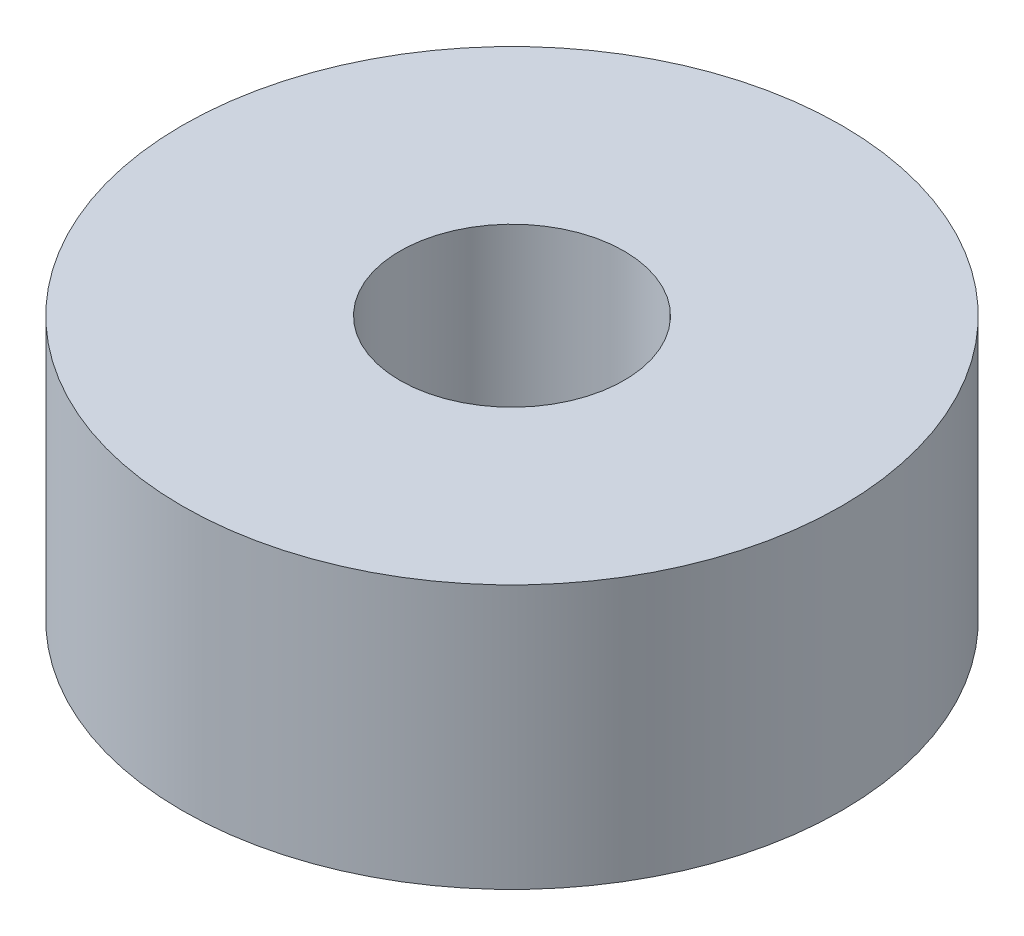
ISO-10303-21;
HEADER;
FILE_DESCRIPTION(('STEP AP214'),'2;1');
FILE_NAME('part.step','',(''),(''),'','','');
FILE_SCHEMA(('AUTOMOTIVE_DESIGN { 1 0 10303 214 1 1 1 1 }'));
ENDSEC;
DATA;
#1=APPLICATION_CONTEXT('core data for automotive mechanical design processes');
#2=APPLICATION_PROTOCOL_DEFINITION('international standard','automotive_design',2000,#1);
#3=PRODUCT_CONTEXT('',#1,'mechanical');
#4=PRODUCT('Part','Part','',(#3));
#5=PRODUCT_RELATED_PRODUCT_CATEGORY('part','',(#4));
#6=PRODUCT_DEFINITION_FORMATION('','',#4);
#7=PRODUCT_DEFINITION_CONTEXT('part definition',#1,'design');
#8=PRODUCT_DEFINITION('design','',#6,#7);
#9=PRODUCT_DEFINITION_SHAPE('','',#8);
#10=(LENGTH_UNIT() NAMED_UNIT(*) SI_UNIT(.MILLI.,.METRE.));
#11=(NAMED_UNIT(*) PLANE_ANGLE_UNIT() SI_UNIT($,.RADIAN.));
#12=(NAMED_UNIT(*) SI_UNIT($,.STERADIAN.) SOLID_ANGLE_UNIT());
#13=UNCERTAINTY_MEASURE_WITH_UNIT(LENGTH_MEASURE(1.E-05),#10,'distance_accuracy_value','');
#14=(GEOMETRIC_REPRESENTATION_CONTEXT(3) GLOBAL_UNCERTAINTY_ASSIGNED_CONTEXT((#13)) GLOBAL_UNIT_ASSIGNED_CONTEXT((#10,
#11,#12)) REPRESENTATION_CONTEXT('',''));
#15=CARTESIAN_POINT('',(0.,0.,0.));
#16=DIRECTION('',(0.,0.,1.));
#17=DIRECTION('',(1.,0.,0.));
#18=AXIS2_PLACEMENT_3D('',#15,#16,#17);
#19=CARTESIAN_POINT('',(-1.11022302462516E-13,4.99999999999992,1.11022302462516E-13));
#20=DIRECTION('',(0.,1.,0.));
#21=DIRECTION('',(0.,0.,1.));
#22=AXIS2_PLACEMENT_3D('',#19,#20,#21);
#23=PLANE('',#22);
#24=CARTESIAN_POINT('',(-1.11022302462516E-13,4.99999999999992,1.11022302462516E-13));
#25=DIRECTION('',(0.,1.,0.));
#26=DIRECTION('',(0.,0.,1.));
#27=AXIS2_PLACEMENT_3D('',#24,#25,#26);
#28=CIRCLE('',#27,12.5);
#29=CARTESIAN_POINT('',(-1.11716191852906E-13,4.99999999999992,12.5000000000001));
#30=VERTEX_POINT('',#29);
#31=EDGE_CURVE('E10',#30,#30,#28,.T.);
#32=ORIENTED_EDGE('',*,*,#31,.T.);
#33=EDGE_LOOP('',(#32));
#34=FACE_BOUND('',#33,.T.);
#35=CARTESIAN_POINT('',(-1.11022302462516E-13,4.99999999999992,1.11022302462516E-13));
#36=DIRECTION('',(0.,1.,0.));
#37=DIRECTION('',(0.,0.,1.));
#38=AXIS2_PLACEMENT_3D('',#35,#36,#37);
#39=CIRCLE('',#38,4.25);
#40=CARTESIAN_POINT('',(-1.11258224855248E-13,4.99999999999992,4.25000000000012));
#41=VERTEX_POINT('',#40);
#42=EDGE_CURVE('E53',#41,#41,#39,.T.);
#43=ORIENTED_EDGE('',*,*,#42,.F.);
#44=EDGE_LOOP('',(#43));
#45=FACE_BOUND('',#44,.T.);
#46=ADVANCED_FACE('F40',(#34,#45),#23,.T.);
#47=CARTESIAN_POINT('',(-1.66533453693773E-13,-5.00000000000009,1.11022302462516E-13));
#48=DIRECTION('',(0.,1.,0.));
#49=DIRECTION('',(0.,0.,1.));
#50=AXIS2_PLACEMENT_3D('',#47,#48,#49);
#51=PLANE('',#50);
#52=CARTESIAN_POINT('',(-1.66533453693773E-13,-5.00000000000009,1.11022302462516E-13));
#53=DIRECTION('',(0.,1.,0.));
#54=DIRECTION('',(0.,0.,1.));
#55=AXIS2_PLACEMENT_3D('',#52,#53,#54);
#56=CIRCLE('',#55,12.5);
#57=CARTESIAN_POINT('',(-1.67227343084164E-13,-5.00000000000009,12.5000000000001));
#58=VERTEX_POINT('',#57);
#59=EDGE_CURVE('E44',#58,#58,#56,.T.);
#60=ORIENTED_EDGE('',*,*,#59,.F.);
#61=EDGE_LOOP('',(#60));
#62=FACE_BOUND('',#61,.T.);
#63=CARTESIAN_POINT('',(-1.66533453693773E-13,-5.00000000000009,1.11022302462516E-13));
#64=DIRECTION('',(0.,1.,0.));
#65=DIRECTION('',(0.,0.,1.));
#66=AXIS2_PLACEMENT_3D('',#63,#64,#65);
#67=CIRCLE('',#66,4.25);
#68=CARTESIAN_POINT('',(-1.66769376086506E-13,-5.00000000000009,4.25000000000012));
#69=VERTEX_POINT('',#68);
#70=EDGE_CURVE('E55',#69,#69,#67,.T.);
#71=ORIENTED_EDGE('',*,*,#70,.T.);
#72=EDGE_LOOP('',(#71));
#73=FACE_BOUND('',#72,.T.);
#74=ADVANCED_FACE('F67',(#62,#73),#51,.F.);
#75=CARTESIAN_POINT('',(-1.11022302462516E-13,4.99999999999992,1.11022302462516E-13));
#76=DIRECTION('',(0.,-1.,0.));
#77=DIRECTION('',(0.,0.,-1.));
#78=AXIS2_PLACEMENT_3D('',#75,#76,#77);
#79=CYLINDRICAL_SURFACE('',#78,12.5);
#80=ORIENTED_EDGE('',*,*,#31,.F.);
#81=EDGE_LOOP('',(#80));
#82=FACE_BOUND('',#81,.T.);
#83=ORIENTED_EDGE('',*,*,#59,.T.);
#84=EDGE_LOOP('',(#83));
#85=FACE_BOUND('',#84,.T.);
#86=ADVANCED_FACE('F42',(#82,#85),#79,.T.);
#87=CARTESIAN_POINT('',(-1.11022302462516E-13,4.99999999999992,1.11022302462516E-13));
#88=DIRECTION('',(0.,-1.,0.));
#89=DIRECTION('',(0.,0.,-1.));
#90=AXIS2_PLACEMENT_3D('',#87,#88,#89);
#91=CYLINDRICAL_SURFACE('',#90,4.25);
#92=ORIENTED_EDGE('',*,*,#42,.T.);
#93=EDGE_LOOP('',(#92));
#94=FACE_BOUND('',#93,.T.);
#95=ORIENTED_EDGE('',*,*,#70,.F.);
#96=EDGE_LOOP('',(#95));
#97=FACE_BOUND('',#96,.T.);
#98=ADVANCED_FACE('F63',(#94,#97),#91,.F.);
#99=CLOSED_SHELL('',(#46,#74,#86,#98));
#100=MANIFOLD_SOLID_BREP('B2',#99);
#101=ADVANCED_BREP_SHAPE_REPRESENTATION('',(#18,#100),#14);
#102=SHAPE_DEFINITION_REPRESENTATION(#9,#101);
ENDSEC;
END-ISO-10303-21;
